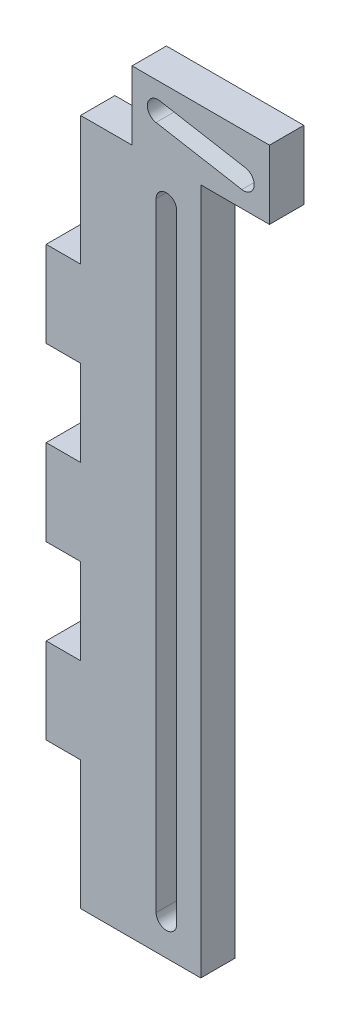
ISO-10303-21;
HEADER;
FILE_DESCRIPTION(('STEP AP214'),'2;1');
FILE_NAME('part.step','',(''),(''),'','','');
FILE_SCHEMA(('AUTOMOTIVE_DESIGN { 1 0 10303 214 1 1 1 1 }'));
ENDSEC;
DATA;
#1=APPLICATION_CONTEXT('core data for automotive mechanical design processes');
#2=APPLICATION_PROTOCOL_DEFINITION('international standard','automotive_design',2000,#1);
#3=PRODUCT_CONTEXT('',#1,'mechanical');
#4=PRODUCT('Part','Part','',(#3));
#5=PRODUCT_RELATED_PRODUCT_CATEGORY('part','',(#4));
#6=PRODUCT_DEFINITION_FORMATION('','',#4);
#7=PRODUCT_DEFINITION_CONTEXT('part definition',#1,'design');
#8=PRODUCT_DEFINITION('design','',#6,#7);
#9=PRODUCT_DEFINITION_SHAPE('','',#8);
#10=(LENGTH_UNIT() NAMED_UNIT(*) SI_UNIT(.MILLI.,.METRE.));
#11=(NAMED_UNIT(*) PLANE_ANGLE_UNIT() SI_UNIT($,.RADIAN.));
#12=(NAMED_UNIT(*) SI_UNIT($,.STERADIAN.) SOLID_ANGLE_UNIT());
#13=UNCERTAINTY_MEASURE_WITH_UNIT(LENGTH_MEASURE(1.E-05),#10,'distance_accuracy_value','');
#14=(GEOMETRIC_REPRESENTATION_CONTEXT(3) GLOBAL_UNCERTAINTY_ASSIGNED_CONTEXT((#13)) GLOBAL_UNIT_ASSIGNED_CONTEXT((#10,
#11,#12)) REPRESENTATION_CONTEXT('',''));
#15=CARTESIAN_POINT('',(0.,0.,0.));
#16=DIRECTION('',(0.,0.,1.));
#17=DIRECTION('',(1.,0.,0.));
#18=AXIS2_PLACEMENT_3D('',#15,#16,#17);
#19=CARTESIAN_POINT('',(0.,44.,2.));
#20=DIRECTION('',(0.,1.,0.));
#21=DIRECTION('',(0.,0.,1.));
#22=AXIS2_PLACEMENT_3D('',#19,#20,#21);
#23=PLANE('',#22);
#24=DIRECTION('',(1.,0.,0.));
#25=VECTOR('',#24,1.);
#26=CARTESIAN_POINT('',(0.,44.,0.));
#27=LINE('',#26,#25);
#28=CARTESIAN_POINT('',(3.,44.,0.));
#29=VERTEX_POINT('',#28);
#30=CARTESIAN_POINT('',(11.,44.,0.));
#31=VERTEX_POINT('',#30);
#32=EDGE_CURVE('E280',#29,#31,#27,.T.);
#33=ORIENTED_EDGE('',*,*,#32,.F.);
#34=DIRECTION('',(0.,0.,-1.));
#35=VECTOR('',#34,1.);
#36=CARTESIAN_POINT('',(3.,44.,2.));
#37=LINE('',#36,#35);
#38=CARTESIAN_POINT('',(3.,44.,2.));
#39=VERTEX_POINT('',#38);
#40=EDGE_CURVE('E11',#39,#29,#37,.T.);
#41=ORIENTED_EDGE('',*,*,#40,.F.);
#42=DIRECTION('',(1.,0.,0.));
#43=VECTOR('',#42,1.);
#44=CARTESIAN_POINT('',(0.,44.,2.));
#45=LINE('',#44,#43);
#46=CARTESIAN_POINT('',(11.,44.,2.));
#47=VERTEX_POINT('',#46);
#48=EDGE_CURVE('E422',#39,#47,#45,.T.);
#49=ORIENTED_EDGE('',*,*,#48,.T.);
#50=DIRECTION('',(0.,0.,-1.));
#51=VECTOR('',#50,1.);
#52=CARTESIAN_POINT('',(11.,44.,2.));
#53=LINE('',#52,#51);
#54=EDGE_CURVE('E54',#47,#31,#53,.T.);
#55=ORIENTED_EDGE('',*,*,#54,.T.);
#56=EDGE_LOOP('',(#33,#41,#49,#55));
#57=FACE_BOUND('',#56,.T.);
#58=ADVANCED_FACE('F35',(#57),#23,.T.);
#59=CARTESIAN_POINT('',(3.,0.,2.));
#60=DIRECTION('',(-1.,0.,0.));
#61=DIRECTION('',(0.,0.,1.));
#62=AXIS2_PLACEMENT_3D('',#59,#60,#61);
#63=PLANE('',#62);
#64=DIRECTION('',(0.,1.,0.));
#65=VECTOR('',#64,1.);
#66=CARTESIAN_POINT('',(3.,0.,0.));
#67=LINE('',#66,#65);
#68=CARTESIAN_POINT('',(3.,40.,0.));
#69=VERTEX_POINT('',#68);
#70=EDGE_CURVE('E282',#69,#29,#67,.T.);
#71=ORIENTED_EDGE('',*,*,#70,.F.);
#72=DIRECTION('',(0.,0.,-1.));
#73=VECTOR('',#72,1.);
#74=CARTESIAN_POINT('',(3.,40.,2.));
#75=LINE('',#74,#73);
#76=CARTESIAN_POINT('',(3.,40.,2.));
#77=VERTEX_POINT('',#76);
#78=EDGE_CURVE('E45',#77,#69,#75,.T.);
#79=ORIENTED_EDGE('',*,*,#78,.F.);
#80=DIRECTION('',(0.,1.,0.));
#81=VECTOR('',#80,1.);
#82=CARTESIAN_POINT('',(3.,0.,2.));
#83=LINE('',#82,#81);
#84=EDGE_CURVE('E424',#77,#39,#83,.T.);
#85=ORIENTED_EDGE('',*,*,#84,.T.);
#86=ORIENTED_EDGE('',*,*,#40,.T.);
#87=EDGE_LOOP('',(#71,#79,#85,#86));
#88=FACE_BOUND('',#87,.T.);
#89=ADVANCED_FACE('F486',(#88),#63,.T.);
#90=CARTESIAN_POINT('',(0.,40.,2.));
#91=DIRECTION('',(0.,1.,0.));
#92=DIRECTION('',(0.,0.,1.));
#93=AXIS2_PLACEMENT_3D('',#90,#91,#92);
#94=PLANE('',#93);
#95=DIRECTION('',(1.,0.,0.));
#96=VECTOR('',#95,1.);
#97=CARTESIAN_POINT('',(0.,40.,0.));
#98=LINE('',#97,#96);
#99=CARTESIAN_POINT('',(0.,40.,0.));
#100=VERTEX_POINT('',#99);
#101=EDGE_CURVE('E285',#100,#69,#98,.T.);
#102=ORIENTED_EDGE('',*,*,#101,.F.);
#103=DIRECTION('',(0.,0.,-1.));
#104=VECTOR('',#103,1.);
#105=CARTESIAN_POINT('',(0.,40.,2.));
#106=LINE('',#105,#104);
#107=CARTESIAN_POINT('',(0.,40.,2.));
#108=VERTEX_POINT('',#107);
#109=EDGE_CURVE('E370',#108,#100,#106,.T.);
#110=ORIENTED_EDGE('',*,*,#109,.F.);
#111=DIRECTION('',(1.,0.,0.));
#112=VECTOR('',#111,1.);
#113=CARTESIAN_POINT('',(0.,40.,2.));
#114=LINE('',#113,#112);
#115=EDGE_CURVE('E427',#108,#77,#114,.T.);
#116=ORIENTED_EDGE('',*,*,#115,.T.);
#117=ORIENTED_EDGE('',*,*,#78,.T.);
#118=EDGE_LOOP('',(#102,#110,#116,#117));
#119=FACE_BOUND('',#118,.T.);
#120=ADVANCED_FACE('F491',(#119),#94,.T.);
#121=CARTESIAN_POINT('',(0.,0.,2.));
#122=DIRECTION('',(-1.,0.,0.));
#123=DIRECTION('',(0.,-1.,0.));
#124=AXIS2_PLACEMENT_3D('',#121,#122,#123);
#125=PLANE('',#124);
#126=DIRECTION('',(0.,1.,0.));
#127=VECTOR('',#126,1.);
#128=CARTESIAN_POINT('',(0.,0.,0.));
#129=LINE('',#128,#127);
#130=CARTESIAN_POINT('',(0.,32.5,0.));
#131=VERTEX_POINT('',#130);
#132=EDGE_CURVE('E288',#131,#100,#129,.T.);
#133=ORIENTED_EDGE('',*,*,#132,.F.);
#134=DIRECTION('',(0.,0.,-1.));
#135=VECTOR('',#134,1.);
#136=CARTESIAN_POINT('',(0.,32.5,2.));
#137=LINE('',#136,#135);
#138=CARTESIAN_POINT('',(0.,32.5,2.));
#139=VERTEX_POINT('',#138);
#140=EDGE_CURVE('E368',#139,#131,#137,.T.);
#141=ORIENTED_EDGE('',*,*,#140,.F.);
#142=DIRECTION('',(0.,1.,0.));
#143=VECTOR('',#142,1.);
#144=CARTESIAN_POINT('',(0.,0.,2.));
#145=LINE('',#144,#143);
#146=EDGE_CURVE('E430',#139,#108,#145,.T.);
#147=ORIENTED_EDGE('',*,*,#146,.T.);
#148=ORIENTED_EDGE('',*,*,#109,.T.);
#149=EDGE_LOOP('',(#133,#141,#147,#148));
#150=FACE_BOUND('',#149,.T.);
#151=ADVANCED_FACE('F665',(#150),#125,.T.);
#152=CARTESIAN_POINT('',(0.,32.5,2.));
#153=DIRECTION('',(0.,-1.,0.));
#154=DIRECTION('',(0.,0.,-1.));
#155=AXIS2_PLACEMENT_3D('',#152,#153,#154);
#156=PLANE('',#155);
#157=DIRECTION('',(-1.,0.,0.));
#158=VECTOR('',#157,1.);
#159=CARTESIAN_POINT('',(0.,32.5,0.));
#160=LINE('',#159,#158);
#161=CARTESIAN_POINT('',(-2.00000000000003,32.5,0.));
#162=VERTEX_POINT('',#161);
#163=EDGE_CURVE('E291',#131,#162,#160,.T.);
#164=ORIENTED_EDGE('',*,*,#163,.T.);
#165=DIRECTION('',(0.,0.,-1.));
#166=VECTOR('',#165,1.);
#167=CARTESIAN_POINT('',(-2.00000000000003,32.5,2.));
#168=LINE('',#167,#166);
#169=CARTESIAN_POINT('',(-2.00000000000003,32.5,2.));
#170=VERTEX_POINT('',#169);
#171=EDGE_CURVE('E365',#170,#162,#168,.T.);
#172=ORIENTED_EDGE('',*,*,#171,.F.);
#173=DIRECTION('',(-1.,0.,0.));
#174=VECTOR('',#173,1.);
#175=CARTESIAN_POINT('',(0.,32.5,2.));
#176=LINE('',#175,#174);
#177=EDGE_CURVE('E433',#139,#170,#176,.T.);
#178=ORIENTED_EDGE('',*,*,#177,.F.);
#179=ORIENTED_EDGE('',*,*,#140,.T.);
#180=EDGE_LOOP('',(#164,#172,#178,#179));
#181=FACE_BOUND('',#180,.T.);
#182=ADVANCED_FACE('F655',(#181),#156,.F.);
#183=CARTESIAN_POINT('',(-1.99999999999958,0.,2.));
#184=DIRECTION('',(1.,0.,0.));
#185=DIRECTION('',(0.,1.,0.));
#186=AXIS2_PLACEMENT_3D('',#183,#184,#185);
#187=PLANE('',#186);
#188=DIRECTION('',(0.,-1.,0.));
#189=VECTOR('',#188,1.);
#190=CARTESIAN_POINT('',(-1.99999999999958,0.,0.));
#191=LINE('',#190,#189);
#192=CARTESIAN_POINT('',(-1.99999999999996,27.5,0.));
#193=VERTEX_POINT('',#192);
#194=EDGE_CURVE('E294',#162,#193,#191,.T.);
#195=ORIENTED_EDGE('',*,*,#194,.T.);
#196=DIRECTION('',(0.,0.,-1.));
#197=VECTOR('',#196,1.);
#198=CARTESIAN_POINT('',(-1.99999999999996,27.5,2.));
#199=LINE('',#198,#197);
#200=CARTESIAN_POINT('',(-1.99999999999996,27.5,2.));
#201=VERTEX_POINT('',#200);
#202=EDGE_CURVE('E363',#201,#193,#199,.T.);
#203=ORIENTED_EDGE('',*,*,#202,.F.);
#204=DIRECTION('',(0.,-1.,0.));
#205=VECTOR('',#204,1.);
#206=CARTESIAN_POINT('',(-1.99999999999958,0.,2.));
#207=LINE('',#206,#205);
#208=EDGE_CURVE('E436',#170,#201,#207,.T.);
#209=ORIENTED_EDGE('',*,*,#208,.F.);
#210=ORIENTED_EDGE('',*,*,#171,.T.);
#211=EDGE_LOOP('',(#195,#203,#209,#210));
#212=FACE_BOUND('',#211,.T.);
#213=ADVANCED_FACE('F645',(#212),#187,.F.);
#214=CARTESIAN_POINT('',(0.,27.5,2.));
#215=DIRECTION('',(0.,-1.,0.));
#216=DIRECTION('',(0.,0.,-1.));
#217=AXIS2_PLACEMENT_3D('',#214,#215,#216);
#218=PLANE('',#217);
#219=DIRECTION('',(-1.,0.,0.));
#220=VECTOR('',#219,1.);
#221=CARTESIAN_POINT('',(0.,27.5,0.));
#222=LINE('',#221,#220);
#223=CARTESIAN_POINT('',(-1.95399252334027E-13,27.5,0.));
#224=VERTEX_POINT('',#223);
#225=EDGE_CURVE('E297',#224,#193,#222,.T.);
#226=ORIENTED_EDGE('',*,*,#225,.F.);
#227=DIRECTION('',(0.,0.,-1.));
#228=VECTOR('',#227,1.);
#229=CARTESIAN_POINT('',(-1.95399252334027E-13,27.5,2.));
#230=LINE('',#229,#228);
#231=CARTESIAN_POINT('',(-1.95399252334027E-13,27.5,2.));
#232=VERTEX_POINT('',#231);
#233=EDGE_CURVE('E361',#232,#224,#230,.T.);
#234=ORIENTED_EDGE('',*,*,#233,.F.);
#235=DIRECTION('',(-1.,0.,0.));
#236=VECTOR('',#235,1.);
#237=CARTESIAN_POINT('',(0.,27.5,2.));
#238=LINE('',#237,#236);
#239=EDGE_CURVE('E438',#232,#201,#238,.T.);
#240=ORIENTED_EDGE('',*,*,#239,.T.);
#241=ORIENTED_EDGE('',*,*,#202,.T.);
#242=EDGE_LOOP('',(#226,#234,#240,#241));
#243=FACE_BOUND('',#242,.T.);
#244=ADVANCED_FACE('F635',(#243),#218,.T.);
#245=CARTESIAN_POINT('',(0.,0.,2.));
#246=DIRECTION('',(-1.,0.,0.));
#247=DIRECTION('',(0.,-1.,0.));
#248=AXIS2_PLACEMENT_3D('',#245,#246,#247);
#249=PLANE('',#248);
#250=DIRECTION('',(0.,1.,0.));
#251=VECTOR('',#250,1.);
#252=CARTESIAN_POINT('',(0.,0.,0.));
#253=LINE('',#252,#251);
#254=CARTESIAN_POINT('',(0.,22.5,0.));
#255=VERTEX_POINT('',#254);
#256=EDGE_CURVE('E300',#255,#224,#253,.T.);
#257=ORIENTED_EDGE('',*,*,#256,.F.);
#258=DIRECTION('',(0.,0.,-1.));
#259=VECTOR('',#258,1.);
#260=CARTESIAN_POINT('',(0.,22.5,2.));
#261=LINE('',#260,#259);
#262=CARTESIAN_POINT('',(0.,22.5,2.));
#263=VERTEX_POINT('',#262);
#264=EDGE_CURVE('E359',#263,#255,#261,.T.);
#265=ORIENTED_EDGE('',*,*,#264,.F.);
#266=DIRECTION('',(0.,1.,0.));
#267=VECTOR('',#266,1.);
#268=CARTESIAN_POINT('',(0.,0.,2.));
#269=LINE('',#268,#267);
#270=EDGE_CURVE('E441',#263,#232,#269,.T.);
#271=ORIENTED_EDGE('',*,*,#270,.T.);
#272=ORIENTED_EDGE('',*,*,#233,.T.);
#273=EDGE_LOOP('',(#257,#265,#271,#272));
#274=FACE_BOUND('',#273,.T.);
#275=ADVANCED_FACE('F624',(#274),#249,.T.);
#276=CARTESIAN_POINT('',(0.,22.5,2.));
#277=DIRECTION('',(0.,-1.,0.));
#278=DIRECTION('',(0.,0.,-1.));
#279=AXIS2_PLACEMENT_3D('',#276,#277,#278);
#280=PLANE('',#279);
#281=DIRECTION('',(-1.,0.,0.));
#282=VECTOR('',#281,1.);
#283=CARTESIAN_POINT('',(0.,22.5,0.));
#284=LINE('',#283,#282);
#285=CARTESIAN_POINT('',(-2.,22.5,0.));
#286=VERTEX_POINT('',#285);
#287=EDGE_CURVE('E303',#255,#286,#284,.T.);
#288=ORIENTED_EDGE('',*,*,#287,.T.);
#289=DIRECTION('',(0.,0.,-1.));
#290=VECTOR('',#289,1.);
#291=CARTESIAN_POINT('',(-2.,22.5,2.));
#292=LINE('',#291,#290);
#293=CARTESIAN_POINT('',(-2.,22.5,2.));
#294=VERTEX_POINT('',#293);
#295=EDGE_CURVE('E356',#294,#286,#292,.T.);
#296=ORIENTED_EDGE('',*,*,#295,.F.);
#297=DIRECTION('',(-1.,0.,0.));
#298=VECTOR('',#297,1.);
#299=CARTESIAN_POINT('',(0.,22.5,2.));
#300=LINE('',#299,#298);
#301=EDGE_CURVE('E444',#263,#294,#300,.T.);
#302=ORIENTED_EDGE('',*,*,#301,.F.);
#303=ORIENTED_EDGE('',*,*,#264,.T.);
#304=EDGE_LOOP('',(#288,#296,#302,#303));
#305=FACE_BOUND('',#304,.T.);
#306=ADVANCED_FACE('F613',(#305),#280,.F.);
#307=CARTESIAN_POINT('',(-2.,0.,2.));
#308=DIRECTION('',(1.,0.,0.));
#309=DIRECTION('',(0.,0.,-1.));
#310=AXIS2_PLACEMENT_3D('',#307,#308,#309);
#311=PLANE('',#310);
#312=DIRECTION('',(0.,-1.,0.));
#313=VECTOR('',#312,1.);
#314=CARTESIAN_POINT('',(-2.,0.,0.));
#315=LINE('',#314,#313);
#316=CARTESIAN_POINT('',(-2.,17.5,0.));
#317=VERTEX_POINT('',#316);
#318=EDGE_CURVE('E306',#286,#317,#315,.T.);
#319=ORIENTED_EDGE('',*,*,#318,.T.);
#320=DIRECTION('',(0.,0.,-1.));
#321=VECTOR('',#320,1.);
#322=CARTESIAN_POINT('',(-2.,17.5,2.));
#323=LINE('',#322,#321);
#324=CARTESIAN_POINT('',(-2.,17.5,2.));
#325=VERTEX_POINT('',#324);
#326=EDGE_CURVE('E354',#325,#317,#323,.T.);
#327=ORIENTED_EDGE('',*,*,#326,.F.);
#328=DIRECTION('',(0.,-1.,0.));
#329=VECTOR('',#328,1.);
#330=CARTESIAN_POINT('',(-2.,0.,2.));
#331=LINE('',#330,#329);
#332=EDGE_CURVE('E447',#294,#325,#331,.T.);
#333=ORIENTED_EDGE('',*,*,#332,.F.);
#334=ORIENTED_EDGE('',*,*,#295,.T.);
#335=EDGE_LOOP('',(#319,#327,#333,#334));
#336=FACE_BOUND('',#335,.T.);
#337=ADVANCED_FACE('F602',(#336),#311,.F.);
#338=CARTESIAN_POINT('',(0.,17.5,2.));
#339=DIRECTION('',(0.,-1.,0.));
#340=DIRECTION('',(1.,0.,0.));
#341=AXIS2_PLACEMENT_3D('',#338,#339,#340);
#342=PLANE('',#341);
#343=DIRECTION('',(-1.,0.,0.));
#344=VECTOR('',#343,1.);
#345=CARTESIAN_POINT('',(0.,17.5,0.));
#346=LINE('',#345,#344);
#347=CARTESIAN_POINT('',(0.,17.5,0.));
#348=VERTEX_POINT('',#347);
#349=EDGE_CURVE('E309',#348,#317,#346,.T.);
#350=ORIENTED_EDGE('',*,*,#349,.F.);
#351=DIRECTION('',(0.,0.,-1.));
#352=VECTOR('',#351,1.);
#353=CARTESIAN_POINT('',(0.,17.5,2.));
#354=LINE('',#353,#352);
#355=CARTESIAN_POINT('',(0.,17.5,2.));
#356=VERTEX_POINT('',#355);
#357=EDGE_CURVE('E352',#356,#348,#354,.T.);
#358=ORIENTED_EDGE('',*,*,#357,.F.);
#359=DIRECTION('',(-1.,0.,0.));
#360=VECTOR('',#359,1.);
#361=CARTESIAN_POINT('',(0.,17.5,2.));
#362=LINE('',#361,#360);
#363=EDGE_CURVE('E449',#356,#325,#362,.T.);
#364=ORIENTED_EDGE('',*,*,#363,.T.);
#365=ORIENTED_EDGE('',*,*,#326,.T.);
#366=EDGE_LOOP('',(#350,#358,#364,#365));
#367=FACE_BOUND('',#366,.T.);
#368=ADVANCED_FACE('F592',(#367),#342,.T.);
#369=CARTESIAN_POINT('',(0.,0.,2.));
#370=DIRECTION('',(-1.,0.,0.));
#371=DIRECTION('',(0.,-1.,0.));
#372=AXIS2_PLACEMENT_3D('',#369,#370,#371);
#373=PLANE('',#372);
#374=DIRECTION('',(0.,1.,0.));
#375=VECTOR('',#374,1.);
#376=CARTESIAN_POINT('',(0.,0.,0.));
#377=LINE('',#376,#375);
#378=CARTESIAN_POINT('',(0.,12.5,0.));
#379=VERTEX_POINT('',#378);
#380=EDGE_CURVE('E312',#379,#348,#377,.T.);
#381=ORIENTED_EDGE('',*,*,#380,.F.);
#382=DIRECTION('',(0.,0.,-1.));
#383=VECTOR('',#382,1.);
#384=CARTESIAN_POINT('',(0.,12.5,2.));
#385=LINE('',#384,#383);
#386=CARTESIAN_POINT('',(0.,12.5,2.));
#387=VERTEX_POINT('',#386);
#388=EDGE_CURVE('E350',#387,#379,#385,.T.);
#389=ORIENTED_EDGE('',*,*,#388,.F.);
#390=DIRECTION('',(0.,1.,0.));
#391=VECTOR('',#390,1.);
#392=CARTESIAN_POINT('',(0.,0.,2.));
#393=LINE('',#392,#391);
#394=EDGE_CURVE('E452',#387,#356,#393,.T.);
#395=ORIENTED_EDGE('',*,*,#394,.T.);
#396=ORIENTED_EDGE('',*,*,#357,.T.);
#397=EDGE_LOOP('',(#381,#389,#395,#396));
#398=FACE_BOUND('',#397,.T.);
#399=ADVANCED_FACE('F582',(#398),#373,.T.);
#400=CARTESIAN_POINT('',(0.,12.5,2.));
#401=DIRECTION('',(0.,-1.,0.));
#402=DIRECTION('',(0.,0.,-1.));
#403=AXIS2_PLACEMENT_3D('',#400,#401,#402);
#404=PLANE('',#403);
#405=DIRECTION('',(-1.,0.,0.));
#406=VECTOR('',#405,1.);
#407=CARTESIAN_POINT('',(0.,12.5,0.));
#408=LINE('',#407,#406);
#409=CARTESIAN_POINT('',(-1.99999999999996,12.5,0.));
#410=VERTEX_POINT('',#409);
#411=EDGE_CURVE('E315',#379,#410,#408,.T.);
#412=ORIENTED_EDGE('',*,*,#411,.T.);
#413=DIRECTION('',(0.,0.,-1.));
#414=VECTOR('',#413,1.);
#415=CARTESIAN_POINT('',(-1.99999999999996,12.5,2.));
#416=LINE('',#415,#414);
#417=CARTESIAN_POINT('',(-1.99999999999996,12.5,2.));
#418=VERTEX_POINT('',#417);
#419=EDGE_CURVE('E347',#418,#410,#416,.T.);
#420=ORIENTED_EDGE('',*,*,#419,.F.);
#421=DIRECTION('',(-1.,0.,0.));
#422=VECTOR('',#421,1.);
#423=CARTESIAN_POINT('',(0.,12.5,2.));
#424=LINE('',#423,#422);
#425=EDGE_CURVE('E455',#387,#418,#424,.T.);
#426=ORIENTED_EDGE('',*,*,#425,.F.);
#427=ORIENTED_EDGE('',*,*,#388,.T.);
#428=EDGE_LOOP('',(#412,#420,#426,#427));
#429=FACE_BOUND('',#428,.T.);
#430=ADVANCED_FACE('F572',(#429),#404,.F.);
#431=CARTESIAN_POINT('',(-1.99999999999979,0.,2.));
#432=DIRECTION('',(1.,0.,0.));
#433=DIRECTION('',(0.,1.,0.));
#434=AXIS2_PLACEMENT_3D('',#431,#432,#433);
#435=PLANE('',#434);
#436=DIRECTION('',(0.,-1.,0.));
#437=VECTOR('',#436,1.);
#438=CARTESIAN_POINT('',(-1.99999999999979,0.,0.));
#439=LINE('',#438,#437);
#440=CARTESIAN_POINT('',(-1.99999999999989,7.5,0.));
#441=VERTEX_POINT('',#440);
#442=EDGE_CURVE('E318',#410,#441,#439,.T.);
#443=ORIENTED_EDGE('',*,*,#442,.T.);
#444=DIRECTION('',(0.,0.,-1.));
#445=VECTOR('',#444,1.);
#446=CARTESIAN_POINT('',(-1.99999999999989,7.5,2.));
#447=LINE('',#446,#445);
#448=CARTESIAN_POINT('',(-1.99999999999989,7.5,2.));
#449=VERTEX_POINT('',#448);
#450=EDGE_CURVE('E345',#449,#441,#447,.T.);
#451=ORIENTED_EDGE('',*,*,#450,.F.);
#452=DIRECTION('',(0.,-1.,0.));
#453=VECTOR('',#452,1.);
#454=CARTESIAN_POINT('',(-1.99999999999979,0.,2.));
#455=LINE('',#454,#453);
#456=EDGE_CURVE('E458',#418,#449,#455,.T.);
#457=ORIENTED_EDGE('',*,*,#456,.F.);
#458=ORIENTED_EDGE('',*,*,#419,.T.);
#459=EDGE_LOOP('',(#443,#451,#457,#458));
#460=FACE_BOUND('',#459,.T.);
#461=ADVANCED_FACE('F563',(#460),#435,.F.);
#462=CARTESIAN_POINT('',(0.,7.5,2.));
#463=DIRECTION('',(0.,-1.,0.));
#464=DIRECTION('',(0.,0.,-1.));
#465=AXIS2_PLACEMENT_3D('',#462,#463,#464);
#466=PLANE('',#465);
#467=DIRECTION('',(-1.,0.,0.));
#468=VECTOR('',#467,1.);
#469=CARTESIAN_POINT('',(0.,7.5,0.));
#470=LINE('',#469,#468);
#471=CARTESIAN_POINT('',(0.,7.5,0.));
#472=VERTEX_POINT('',#471);
#473=EDGE_CURVE('E321',#472,#441,#470,.T.);
#474=ORIENTED_EDGE('',*,*,#473,.F.);
#475=DIRECTION('',(0.,0.,-1.));
#476=VECTOR('',#475,1.);
#477=CARTESIAN_POINT('',(0.,7.5,2.));
#478=LINE('',#477,#476);
#479=CARTESIAN_POINT('',(0.,7.5,2.));
#480=VERTEX_POINT('',#479);
#481=EDGE_CURVE('E343',#480,#472,#478,.T.);
#482=ORIENTED_EDGE('',*,*,#481,.F.);
#483=DIRECTION('',(-1.,0.,0.));
#484=VECTOR('',#483,1.);
#485=CARTESIAN_POINT('',(0.,7.5,2.));
#486=LINE('',#485,#484);
#487=EDGE_CURVE('E460',#480,#449,#486,.T.);
#488=ORIENTED_EDGE('',*,*,#487,.T.);
#489=ORIENTED_EDGE('',*,*,#450,.T.);
#490=EDGE_LOOP('',(#474,#482,#488,#489));
#491=FACE_BOUND('',#490,.T.);
#492=ADVANCED_FACE('F472',(#491),#466,.T.);
#493=CARTESIAN_POINT('',(0.,0.,2.));
#494=DIRECTION('',(-1.,0.,0.));
#495=DIRECTION('',(0.,-1.,0.));
#496=AXIS2_PLACEMENT_3D('',#493,#494,#495);
#497=PLANE('',#496);
#498=DIRECTION('',(0.,1.,0.));
#499=VECTOR('',#498,1.);
#500=CARTESIAN_POINT('',(0.,0.,0.));
#501=LINE('',#500,#499);
#502=CARTESIAN_POINT('',(0.,0.,0.));
#503=VERTEX_POINT('',#502);
#504=EDGE_CURVE('E324',#503,#472,#501,.T.);
#505=ORIENTED_EDGE('',*,*,#504,.F.);
#506=DIRECTION('',(0.,0.,-1.));
#507=VECTOR('',#506,1.);
#508=CARTESIAN_POINT('',(0.,0.,2.));
#509=LINE('',#508,#507);
#510=CARTESIAN_POINT('',(0.,0.,2.));
#511=VERTEX_POINT('',#510);
#512=EDGE_CURVE('E341',#511,#503,#509,.T.);
#513=ORIENTED_EDGE('',*,*,#512,.F.);
#514=DIRECTION('',(0.,1.,0.));
#515=VECTOR('',#514,1.);
#516=CARTESIAN_POINT('',(0.,0.,2.));
#517=LINE('',#516,#515);
#518=EDGE_CURVE('E463',#511,#480,#517,.T.);
#519=ORIENTED_EDGE('',*,*,#518,.T.);
#520=ORIENTED_EDGE('',*,*,#481,.T.);
#521=EDGE_LOOP('',(#505,#513,#519,#520));
#522=FACE_BOUND('',#521,.T.);
#523=ADVANCED_FACE('F467',(#522),#497,.T.);
#524=CARTESIAN_POINT('',(0.,0.,2.));
#525=DIRECTION('',(0.,1.,0.));
#526=DIRECTION('',(0.,0.,1.));
#527=AXIS2_PLACEMENT_3D('',#524,#525,#526);
#528=PLANE('',#527);
#529=DIRECTION('',(1.,0.,0.));
#530=VECTOR('',#529,1.);
#531=CARTESIAN_POINT('',(0.,0.,0.));
#532=LINE('',#531,#530);
#533=CARTESIAN_POINT('',(7.,0.,0.));
#534=VERTEX_POINT('',#533);
#535=EDGE_CURVE('E327',#503,#534,#532,.T.);
#536=ORIENTED_EDGE('',*,*,#535,.T.);
#537=DIRECTION('',(0.,0.,-1.));
#538=VECTOR('',#537,1.);
#539=CARTESIAN_POINT('',(7.,0.,2.));
#540=LINE('',#539,#538);
#541=CARTESIAN_POINT('',(7.,0.,2.));
#542=VERTEX_POINT('',#541);
#543=EDGE_CURVE('E247',#542,#534,#540,.T.);
#544=ORIENTED_EDGE('',*,*,#543,.F.);
#545=DIRECTION('',(1.,0.,0.));
#546=VECTOR('',#545,1.);
#547=CARTESIAN_POINT('',(0.,0.,2.));
#548=LINE('',#547,#546);
#549=EDGE_CURVE('E236',#511,#542,#548,.T.);
#550=ORIENTED_EDGE('',*,*,#549,.F.);
#551=ORIENTED_EDGE('',*,*,#512,.T.);
#552=EDGE_LOOP('',(#536,#544,#550,#551));
#553=FACE_BOUND('',#552,.T.);
#554=ADVANCED_FACE('F476',(#553),#528,.F.);
#555=CARTESIAN_POINT('',(7.,0.,2.));
#556=DIRECTION('',(-1.,0.,0.));
#557=DIRECTION('',(0.,0.,1.));
#558=AXIS2_PLACEMENT_3D('',#555,#556,#557);
#559=PLANE('',#558);
#560=DIRECTION('',(0.,1.,0.));
#561=VECTOR('',#560,1.);
#562=CARTESIAN_POINT('',(7.,0.,0.));
#563=LINE('',#562,#561);
#564=CARTESIAN_POINT('',(7.,40.,0.));
#565=VERTEX_POINT('',#564);
#566=EDGE_CURVE('E244',#534,#565,#563,.T.);
#567=ORIENTED_EDGE('',*,*,#566,.T.);
#568=DIRECTION('',(0.,0.,-1.));
#569=VECTOR('',#568,1.);
#570=CARTESIAN_POINT('',(7.,40.,2.));
#571=LINE('',#570,#569);
#572=CARTESIAN_POINT('',(7.,40.,2.));
#573=VERTEX_POINT('',#572);
#574=EDGE_CURVE('E242',#573,#565,#571,.T.);
#575=ORIENTED_EDGE('',*,*,#574,.F.);
#576=DIRECTION('',(0.,1.,0.));
#577=VECTOR('',#576,1.);
#578=CARTESIAN_POINT('',(7.,0.,2.));
#579=LINE('',#578,#577);
#580=EDGE_CURVE('E227',#542,#573,#579,.T.);
#581=ORIENTED_EDGE('',*,*,#580,.F.);
#582=ORIENTED_EDGE('',*,*,#543,.T.);
#583=EDGE_LOOP('',(#567,#575,#581,#582));
#584=FACE_BOUND('',#583,.T.);
#585=ADVANCED_FACE('F243',(#584),#559,.F.);
#586=CARTESIAN_POINT('',(0.,40.,2.));
#587=DIRECTION('',(0.,-1.,0.));
#588=DIRECTION('',(1.,0.,0.));
#589=AXIS2_PLACEMENT_3D('',#586,#587,#588);
#590=PLANE('',#589);
#591=DIRECTION('',(-1.,0.,0.));
#592=VECTOR('',#591,1.);
#593=CARTESIAN_POINT('',(0.,40.,0.));
#594=LINE('',#593,#592);
#595=CARTESIAN_POINT('',(11.,40.,0.));
#596=VERTEX_POINT('',#595);
#597=EDGE_CURVE('E331',#596,#565,#594,.T.);
#598=ORIENTED_EDGE('',*,*,#597,.F.);
#599=DIRECTION('',(0.,0.,-1.));
#600=VECTOR('',#599,1.);
#601=CARTESIAN_POINT('',(11.,40.,2.));
#602=LINE('',#601,#600);
#603=CARTESIAN_POINT('',(11.,40.,2.));
#604=VERTEX_POINT('',#603);
#605=EDGE_CURVE('E139',#604,#596,#602,.T.);
#606=ORIENTED_EDGE('',*,*,#605,.F.);
#607=DIRECTION('',(-1.,0.,0.));
#608=VECTOR('',#607,1.);
#609=CARTESIAN_POINT('',(0.,40.,2.));
#610=LINE('',#609,#608);
#611=EDGE_CURVE('E233',#604,#573,#610,.T.);
#612=ORIENTED_EDGE('',*,*,#611,.T.);
#613=ORIENTED_EDGE('',*,*,#574,.T.);
#614=EDGE_LOOP('',(#598,#606,#612,#613));
#615=FACE_BOUND('',#614,.T.);
#616=ADVANCED_FACE('F249',(#615),#590,.T.);
#617=CARTESIAN_POINT('',(5.,2.,2.));
#618=DIRECTION('',(0.,0.,-1.));
#619=DIRECTION('',(-1.,0.,0.));
#620=AXIS2_PLACEMENT_3D('',#617,#618,#619);
#621=CYLINDRICAL_SURFACE('',#620,0.600000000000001);
#622=CARTESIAN_POINT('',(5.,2.,0.));
#623=DIRECTION('',(0.,0.,1.));
#624=DIRECTION('',(1.,0.,0.));
#625=AXIS2_PLACEMENT_3D('',#622,#623,#624);
#626=CIRCLE('',#625,0.600000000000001);
#627=CARTESIAN_POINT('',(4.4,2.,0.));
#628=VERTEX_POINT('',#627);
#629=CARTESIAN_POINT('',(5.6,2.,0.));
#630=VERTEX_POINT('',#629);
#631=EDGE_CURVE('E268',#628,#630,#626,.T.);
#632=ORIENTED_EDGE('',*,*,#631,.F.);
#633=DIRECTION('',(0.,0.,-1.));
#634=VECTOR('',#633,1.);
#635=CARTESIAN_POINT('',(4.4,2.,2.));
#636=LINE('',#635,#634);
#637=CARTESIAN_POINT('',(4.4,2.,2.));
#638=VERTEX_POINT('',#637);
#639=EDGE_CURVE('E338',#638,#628,#636,.T.);
#640=ORIENTED_EDGE('',*,*,#639,.F.);
#641=CARTESIAN_POINT('',(5.,2.,2.));
#642=DIRECTION('',(0.,0.,1.));
#643=DIRECTION('',(1.,0.,0.));
#644=AXIS2_PLACEMENT_3D('',#641,#642,#643);
#645=CIRCLE('',#644,0.600000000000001);
#646=CARTESIAN_POINT('',(5.6,2.,2.));
#647=VERTEX_POINT('',#646);
#648=EDGE_CURVE('E405',#638,#647,#645,.T.);
#649=ORIENTED_EDGE('',*,*,#648,.T.);
#650=DIRECTION('',(0.,0.,-1.));
#651=VECTOR('',#650,1.);
#652=CARTESIAN_POINT('',(5.6,2.,2.));
#653=LINE('',#652,#651);
#654=EDGE_CURVE('E373',#647,#630,#653,.T.);
#655=ORIENTED_EDGE('',*,*,#654,.T.);
#656=EDGE_LOOP('',(#632,#640,#649,#655));
#657=FACE_BOUND('',#656,.T.);
#658=ADVANCED_FACE('F507',(#657),#621,.F.);
#659=CARTESIAN_POINT('',(4.4,0.,2.));
#660=DIRECTION('',(1.,0.,0.));
#661=DIRECTION('',(0.,1.,0.));
#662=AXIS2_PLACEMENT_3D('',#659,#660,#661);
#663=PLANE('',#662);
#664=DIRECTION('',(0.,-1.,0.));
#665=VECTOR('',#664,1.);
#666=CARTESIAN_POINT('',(4.4,0.,0.));
#667=LINE('',#666,#665);
#668=CARTESIAN_POINT('',(4.4,38.,0.));
#669=VERTEX_POINT('',#668);
#670=EDGE_CURVE('E271',#669,#628,#667,.T.);
#671=ORIENTED_EDGE('',*,*,#670,.F.);
#672=DIRECTION('',(0.,0.,-1.));
#673=VECTOR('',#672,1.);
#674=CARTESIAN_POINT('',(4.4,38.,2.));
#675=LINE('',#674,#673);
#676=CARTESIAN_POINT('',(4.4,38.,2.));
#677=VERTEX_POINT('',#676);
#678=EDGE_CURVE('E377',#677,#669,#675,.T.);
#679=ORIENTED_EDGE('',*,*,#678,.F.);
#680=DIRECTION('',(0.,-1.,0.));
#681=VECTOR('',#680,1.);
#682=CARTESIAN_POINT('',(4.4,0.,2.));
#683=LINE('',#682,#681);
#684=EDGE_CURVE('E414',#677,#638,#683,.T.);
#685=ORIENTED_EDGE('',*,*,#684,.T.);
#686=ORIENTED_EDGE('',*,*,#639,.T.);
#687=EDGE_LOOP('',(#671,#679,#685,#686));
#688=FACE_BOUND('',#687,.T.);
#689=ADVANCED_FACE('F503',(#688),#663,.T.);
#690=CARTESIAN_POINT('',(5.,38.,2.));
#691=DIRECTION('',(0.,0.,-1.));
#692=DIRECTION('',(-1.,0.,0.));
#693=AXIS2_PLACEMENT_3D('',#690,#691,#692);
#694=CYLINDRICAL_SURFACE('',#693,0.6);
#695=CARTESIAN_POINT('',(5.,38.,0.));
#696=DIRECTION('',(0.,0.,1.));
#697=DIRECTION('',(1.,0.,0.));
#698=AXIS2_PLACEMENT_3D('',#695,#696,#697);
#699=CIRCLE('',#698,0.6);
#700=CARTESIAN_POINT('',(5.6,38.,0.));
#701=VERTEX_POINT('',#700);
#702=EDGE_CURVE('E274',#701,#669,#699,.T.);
#703=ORIENTED_EDGE('',*,*,#702,.F.);
#704=DIRECTION('',(0.,0.,-1.));
#705=VECTOR('',#704,1.);
#706=CARTESIAN_POINT('',(5.6,38.,2.));
#707=LINE('',#706,#705);
#708=CARTESIAN_POINT('',(5.6,38.,2.));
#709=VERTEX_POINT('',#708);
#710=EDGE_CURVE('E375',#709,#701,#707,.T.);
#711=ORIENTED_EDGE('',*,*,#710,.F.);
#712=CARTESIAN_POINT('',(5.,38.,2.));
#713=DIRECTION('',(0.,0.,1.));
#714=DIRECTION('',(1.,0.,0.));
#715=AXIS2_PLACEMENT_3D('',#712,#713,#714);
#716=CIRCLE('',#715,0.6);
#717=EDGE_CURVE('E417',#709,#677,#716,.T.);
#718=ORIENTED_EDGE('',*,*,#717,.T.);
#719=ORIENTED_EDGE('',*,*,#678,.T.);
#720=EDGE_LOOP('',(#703,#711,#718,#719));
#721=FACE_BOUND('',#720,.T.);
#722=ADVANCED_FACE('F500',(#721),#694,.F.);
#723=CARTESIAN_POINT('',(9.5,41.5591825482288,2.));
#724=DIRECTION('',(0.,0.,-1.));
#725=DIRECTION('',(-1.,0.,0.));
#726=AXIS2_PLACEMENT_3D('',#723,#724,#725);
#727=CYLINDRICAL_SURFACE('',#726,0.610000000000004);
#728=CARTESIAN_POINT('',(9.5,41.5591825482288,0.));
#729=DIRECTION('',(0.,0.,1.));
#730=DIRECTION('',(1.,0.,0.));
#731=AXIS2_PLACEMENT_3D('',#728,#729,#730);
#732=CIRCLE('',#731,0.610000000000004);
#733=CARTESIAN_POINT('',(9.39407461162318,40.9584498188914,0.));
#734=VERTEX_POINT('',#733);
#735=CARTESIAN_POINT('',(9.60592538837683,42.1599152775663,0.));
#736=VERTEX_POINT('',#735);
#737=EDGE_CURVE('E256',#734,#736,#732,.T.);
#738=ORIENTED_EDGE('',*,*,#737,.F.);
#739=DIRECTION('',(0.,0.,-1.));
#740=VECTOR('',#739,1.);
#741=CARTESIAN_POINT('',(9.39407461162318,40.9584498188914,2.));
#742=LINE('',#741,#740);
#743=CARTESIAN_POINT('',(9.39407461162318,40.9584498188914,2.));
#744=VERTEX_POINT('',#743);
#745=EDGE_CURVE('E39',#744,#734,#742,.T.);
#746=ORIENTED_EDGE('',*,*,#745,.F.);
#747=CARTESIAN_POINT('',(9.5,41.5591825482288,2.));
#748=DIRECTION('',(0.,0.,1.));
#749=DIRECTION('',(1.,0.,0.));
#750=AXIS2_PLACEMENT_3D('',#747,#748,#749);
#751=CIRCLE('',#750,0.610000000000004);
#752=CARTESIAN_POINT('',(9.60592538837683,42.1599152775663,2.));
#753=VERTEX_POINT('',#752);
#754=EDGE_CURVE('E336',#744,#753,#751,.T.);
#755=ORIENTED_EDGE('',*,*,#754,.T.);
#756=DIRECTION('',(0.,0.,-1.));
#757=VECTOR('',#756,1.);
#758=CARTESIAN_POINT('',(9.60592538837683,42.1599152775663,2.));
#759=LINE('',#758,#757);
#760=EDGE_CURVE('E252',#753,#736,#759,.T.);
#761=ORIENTED_EDGE('',*,*,#760,.T.);
#762=EDGE_LOOP('',(#738,#746,#755,#761));
#763=FACE_BOUND('',#762,.T.);
#764=ADVANCED_FACE('F37',(#763),#727,.F.);
#765=CARTESIAN_POINT('',(7.28757344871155,41.3298828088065,2.));
#766=DIRECTION('',(0.173648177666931,0.984807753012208,0.));
#767=DIRECTION('',(-0.984807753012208,0.173648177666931,0.));
#768=AXIS2_PLACEMENT_3D('',#765,#766,#767);
#769=PLANE('',#768);
#770=DIRECTION('',(0.984807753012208,-0.173648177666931,0.));
#771=VECTOR('',#770,1.);
#772=CARTESIAN_POINT('',(7.28757344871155,41.3298828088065,0.));
#773=LINE('',#772,#771);
#774=CARTESIAN_POINT('',(4.39407461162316,41.8400847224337,0.));
#775=VERTEX_POINT('',#774);
#776=EDGE_CURVE('E259',#775,#734,#773,.T.);
#777=ORIENTED_EDGE('',*,*,#776,.F.);
#778=DIRECTION('',(0.,0.,-1.));
#779=VECTOR('',#778,1.);
#780=CARTESIAN_POINT('',(4.39407461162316,41.8400847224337,2.));
#781=LINE('',#780,#779);
#782=CARTESIAN_POINT('',(4.39407461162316,41.8400847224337,2.));
#783=VERTEX_POINT('',#782);
#784=EDGE_CURVE('E382',#783,#775,#781,.T.);
#785=ORIENTED_EDGE('',*,*,#784,.F.);
#786=DIRECTION('',(0.984807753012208,-0.173648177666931,0.));
#787=VECTOR('',#786,1.);
#788=CARTESIAN_POINT('',(7.28757344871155,41.3298828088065,2.));
#789=LINE('',#788,#787);
#790=EDGE_CURVE('E391',#783,#744,#789,.T.);
#791=ORIENTED_EDGE('',*,*,#790,.T.);
#792=ORIENTED_EDGE('',*,*,#745,.T.);
#793=EDGE_LOOP('',(#777,#785,#791,#792));
#794=FACE_BOUND('',#793,.T.);
#795=ADVANCED_FACE('F389',(#794),#769,.T.);
#796=CARTESIAN_POINT('',(4.49999999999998,42.4408174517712,2.));
#797=DIRECTION('',(0.,0.,-1.));
#798=DIRECTION('',(-1.,0.,0.));
#799=AXIS2_PLACEMENT_3D('',#796,#797,#798);
#800=CYLINDRICAL_SURFACE('',#799,0.610000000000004);
#801=CARTESIAN_POINT('',(4.49999999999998,42.4408174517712,0.));
#802=DIRECTION('',(0.,0.,1.));
#803=DIRECTION('',(1.,0.,0.));
#804=AXIS2_PLACEMENT_3D('',#801,#802,#803);
#805=CIRCLE('',#804,0.610000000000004);
#806=CARTESIAN_POINT('',(4.60592538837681,43.0415501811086,0.));
#807=VERTEX_POINT('',#806);
#808=EDGE_CURVE('E262',#807,#775,#805,.T.);
#809=ORIENTED_EDGE('',*,*,#808,.F.);
#810=DIRECTION('',(0.,0.,-1.));
#811=VECTOR('',#810,1.);
#812=CARTESIAN_POINT('',(4.60592538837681,43.0415501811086,2.));
#813=LINE('',#812,#811);
#814=CARTESIAN_POINT('',(4.60592538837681,43.0415501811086,2.));
#815=VERTEX_POINT('',#814);
#816=EDGE_CURVE('E381',#815,#807,#813,.T.);
#817=ORIENTED_EDGE('',*,*,#816,.F.);
#818=CARTESIAN_POINT('',(4.49999999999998,42.4408174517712,2.));
#819=DIRECTION('',(0.,0.,1.));
#820=DIRECTION('',(1.,0.,0.));
#821=AXIS2_PLACEMENT_3D('',#818,#819,#820);
#822=CIRCLE('',#821,0.610000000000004);
#823=EDGE_CURVE('E400',#815,#783,#822,.T.);
#824=ORIENTED_EDGE('',*,*,#823,.T.);
#825=ORIENTED_EDGE('',*,*,#784,.T.);
#826=EDGE_LOOP('',(#809,#817,#824,#825));
#827=FACE_BOUND('',#826,.T.);
#828=ADVANCED_FACE('F397',(#827),#800,.F.);
#829=CARTESIAN_POINT('',(5.6,0.,2.));
#830=DIRECTION('',(1.,0.,0.));
#831=DIRECTION('',(0.,1.,0.));
#832=AXIS2_PLACEMENT_3D('',#829,#830,#831);
#833=PLANE('',#832);
#834=DIRECTION('',(0.,-1.,0.));
#835=VECTOR('',#834,1.);
#836=CARTESIAN_POINT('',(5.6,0.,0.));
#837=LINE('',#836,#835);
#838=EDGE_CURVE('E277',#701,#630,#837,.T.);
#839=ORIENTED_EDGE('',*,*,#838,.T.);
#840=ORIENTED_EDGE('',*,*,#654,.F.);
#841=DIRECTION('',(0.,-1.,0.));
#842=VECTOR('',#841,1.);
#843=CARTESIAN_POINT('',(5.6,0.,2.));
#844=LINE('',#843,#842);
#845=EDGE_CURVE('E420',#709,#647,#844,.T.);
#846=ORIENTED_EDGE('',*,*,#845,.F.);
#847=ORIENTED_EDGE('',*,*,#710,.T.);
#848=EDGE_LOOP('',(#839,#840,#846,#847));
#849=FACE_BOUND('',#848,.T.);
#850=ADVANCED_FACE('F496',(#849),#833,.F.);
#851=CARTESIAN_POINT('',(7.49942422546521,42.5313482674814,2.));
#852=DIRECTION('',(0.173648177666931,0.984807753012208,0.));
#853=DIRECTION('',(-0.984807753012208,0.173648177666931,0.));
#854=AXIS2_PLACEMENT_3D('',#851,#852,#853);
#855=PLANE('',#854);
#856=DIRECTION('',(0.984807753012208,-0.173648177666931,0.));
#857=VECTOR('',#856,1.);
#858=CARTESIAN_POINT('',(7.49942422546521,42.5313482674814,0.));
#859=LINE('',#858,#857);
#860=EDGE_CURVE('E265',#807,#736,#859,.T.);
#861=ORIENTED_EDGE('',*,*,#860,.T.);
#862=ORIENTED_EDGE('',*,*,#760,.F.);
#863=DIRECTION('',(0.984807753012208,-0.173648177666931,0.));
#864=VECTOR('',#863,1.);
#865=CARTESIAN_POINT('',(7.49942422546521,42.5313482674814,2.));
#866=LINE('',#865,#864);
#867=EDGE_CURVE('E402',#815,#753,#866,.T.);
#868=ORIENTED_EDGE('',*,*,#867,.F.);
#869=ORIENTED_EDGE('',*,*,#816,.T.);
#870=EDGE_LOOP('',(#861,#862,#868,#869));
#871=FACE_BOUND('',#870,.T.);
#872=ADVANCED_FACE('F403',(#871),#855,.F.);
#873=CARTESIAN_POINT('',(11.,0.,2.));
#874=DIRECTION('',(1.,0.,0.));
#875=DIRECTION('',(0.,0.,-1.));
#876=AXIS2_PLACEMENT_3D('',#873,#874,#875);
#877=PLANE('',#876);
#878=DIRECTION('',(0.,-1.,0.));
#879=VECTOR('',#878,1.);
#880=CARTESIAN_POINT('',(11.,0.,0.));
#881=LINE('',#880,#879);
#882=EDGE_CURVE('E333',#31,#596,#881,.T.);
#883=ORIENTED_EDGE('',*,*,#882,.F.);
#884=ORIENTED_EDGE('',*,*,#54,.F.);
#885=DIRECTION('',(0.,-1.,0.));
#886=VECTOR('',#885,1.);
#887=CARTESIAN_POINT('',(11.,0.,2.));
#888=LINE('',#887,#886);
#889=EDGE_CURVE('E250',#47,#604,#888,.T.);
#890=ORIENTED_EDGE('',*,*,#889,.T.);
#891=ORIENTED_EDGE('',*,*,#605,.T.);
#892=EDGE_LOOP('',(#883,#884,#890,#891));
#893=FACE_BOUND('',#892,.T.);
#894=ADVANCED_FACE('F514',(#893),#877,.T.);
#895=CARTESIAN_POINT('',(0.,0.,2.));
#896=DIRECTION('',(0.,0.,1.));
#897=DIRECTION('',(1.,0.,0.));
#898=AXIS2_PLACEMENT_3D('',#895,#896,#897);
#899=PLANE('',#898);
#900=ORIENTED_EDGE('',*,*,#754,.F.);
#901=ORIENTED_EDGE('',*,*,#790,.F.);
#902=ORIENTED_EDGE('',*,*,#823,.F.);
#903=ORIENTED_EDGE('',*,*,#867,.T.);
#904=EDGE_LOOP('',(#900,#901,#902,#903));
#905=FACE_BOUND('',#904,.T.);
#906=ORIENTED_EDGE('',*,*,#648,.F.);
#907=ORIENTED_EDGE('',*,*,#684,.F.);
#908=ORIENTED_EDGE('',*,*,#717,.F.);
#909=ORIENTED_EDGE('',*,*,#845,.T.);
#910=EDGE_LOOP('',(#906,#907,#908,#909));
#911=FACE_BOUND('',#910,.T.);
#912=ORIENTED_EDGE('',*,*,#48,.F.);
#913=ORIENTED_EDGE('',*,*,#84,.F.);
#914=ORIENTED_EDGE('',*,*,#115,.F.);
#915=ORIENTED_EDGE('',*,*,#146,.F.);
#916=ORIENTED_EDGE('',*,*,#177,.T.);
#917=ORIENTED_EDGE('',*,*,#208,.T.);
#918=ORIENTED_EDGE('',*,*,#239,.F.);
#919=ORIENTED_EDGE('',*,*,#270,.F.);
#920=ORIENTED_EDGE('',*,*,#301,.T.);
#921=ORIENTED_EDGE('',*,*,#332,.T.);
#922=ORIENTED_EDGE('',*,*,#363,.F.);
#923=ORIENTED_EDGE('',*,*,#394,.F.);
#924=ORIENTED_EDGE('',*,*,#425,.T.);
#925=ORIENTED_EDGE('',*,*,#456,.T.);
#926=ORIENTED_EDGE('',*,*,#487,.F.);
#927=ORIENTED_EDGE('',*,*,#518,.F.);
#928=ORIENTED_EDGE('',*,*,#549,.T.);
#929=ORIENTED_EDGE('',*,*,#580,.T.);
#930=ORIENTED_EDGE('',*,*,#611,.F.);
#931=ORIENTED_EDGE('',*,*,#889,.F.);
#932=EDGE_LOOP('',(#912,#913,#914,#915,#916,#917,#918,#919,#920,#921,#922,#923,#924,#925,#926,
#927,#928,#929,#930,#931));
#933=FACE_BOUND('',#932,.T.);
#934=ADVANCED_FACE('F230',(#905,#911,#933),#899,.T.);
#935=CARTESIAN_POINT('',(0.,0.,0.));
#936=DIRECTION('',(0.,0.,1.));
#937=DIRECTION('',(1.,0.,0.));
#938=AXIS2_PLACEMENT_3D('',#935,#936,#937);
#939=PLANE('',#938);
#940=ORIENTED_EDGE('',*,*,#737,.T.);
#941=ORIENTED_EDGE('',*,*,#860,.F.);
#942=ORIENTED_EDGE('',*,*,#808,.T.);
#943=ORIENTED_EDGE('',*,*,#776,.T.);
#944=EDGE_LOOP('',(#940,#941,#942,#943));
#945=FACE_BOUND('',#944,.T.);
#946=ORIENTED_EDGE('',*,*,#631,.T.);
#947=ORIENTED_EDGE('',*,*,#838,.F.);
#948=ORIENTED_EDGE('',*,*,#702,.T.);
#949=ORIENTED_EDGE('',*,*,#670,.T.);
#950=EDGE_LOOP('',(#946,#947,#948,#949));
#951=FACE_BOUND('',#950,.T.);
#952=ORIENTED_EDGE('',*,*,#32,.T.);
#953=ORIENTED_EDGE('',*,*,#882,.T.);
#954=ORIENTED_EDGE('',*,*,#597,.T.);
#955=ORIENTED_EDGE('',*,*,#566,.F.);
#956=ORIENTED_EDGE('',*,*,#535,.F.);
#957=ORIENTED_EDGE('',*,*,#504,.T.);
#958=ORIENTED_EDGE('',*,*,#473,.T.);
#959=ORIENTED_EDGE('',*,*,#442,.F.);
#960=ORIENTED_EDGE('',*,*,#411,.F.);
#961=ORIENTED_EDGE('',*,*,#380,.T.);
#962=ORIENTED_EDGE('',*,*,#349,.T.);
#963=ORIENTED_EDGE('',*,*,#318,.F.);
#964=ORIENTED_EDGE('',*,*,#287,.F.);
#965=ORIENTED_EDGE('',*,*,#256,.T.);
#966=ORIENTED_EDGE('',*,*,#225,.T.);
#967=ORIENTED_EDGE('',*,*,#194,.F.);
#968=ORIENTED_EDGE('',*,*,#163,.F.);
#969=ORIENTED_EDGE('',*,*,#132,.T.);
#970=ORIENTED_EDGE('',*,*,#101,.T.);
#971=ORIENTED_EDGE('',*,*,#70,.T.);
#972=EDGE_LOOP('',(#952,#953,#954,#955,#956,#957,#958,#959,#960,#961,#962,#963,#964,#965,#966,
#967,#968,#969,#970,#971));
#973=FACE_BOUND('',#972,.T.);
#974=ADVANCED_FACE('F395',(#945,#951,#973),#939,.F.);
#975=CLOSED_SHELL('',(#58,#89,#120,#151,#182,#213,#244,#275,#306,#337,#368,#399,#430,#461,#492,
#523,#554,#585,#616,#658,#689,#722,#764,#795,#828,#850,#872,#894,#934,#974));
#976=MANIFOLD_SOLID_BREP('B2',#975);
#977=ADVANCED_BREP_SHAPE_REPRESENTATION('',(#18,#976),#14);
#978=SHAPE_DEFINITION_REPRESENTATION(#9,#977);
ENDSEC;
END-ISO-10303-21;
